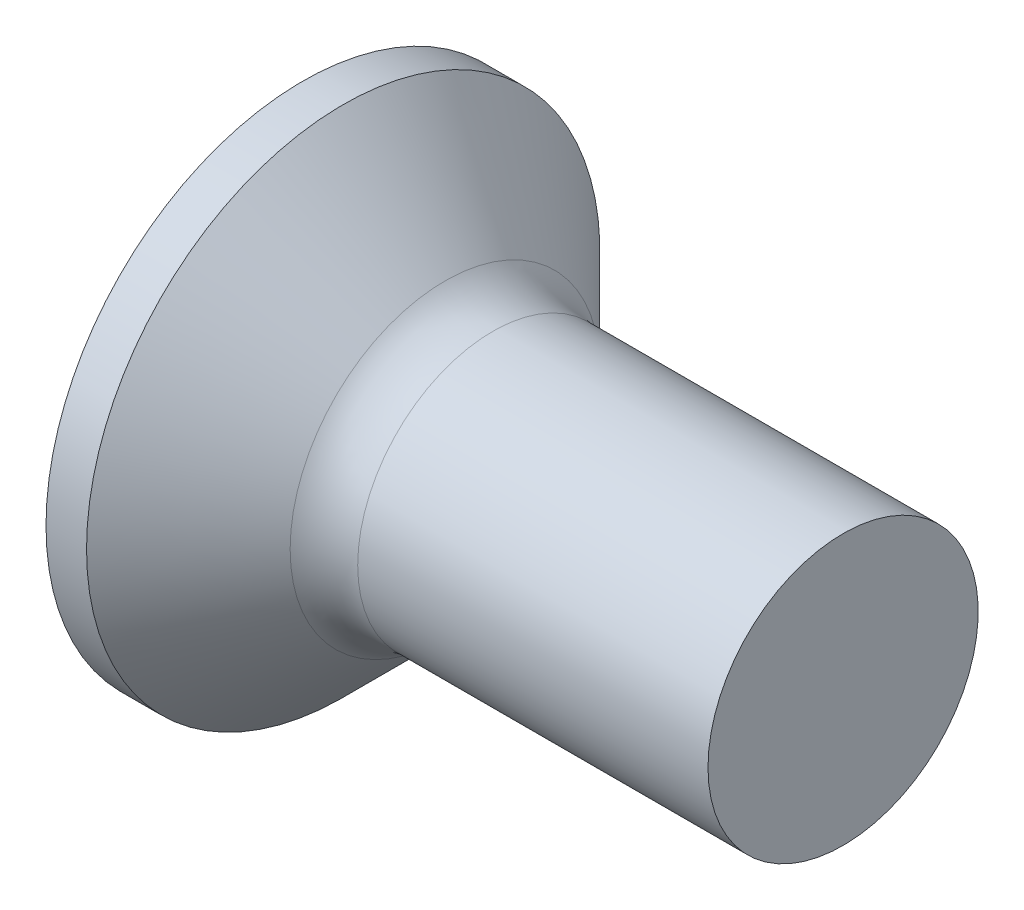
from build123d import *

# Parameters (mm, degrees)
FILLET1_R    = 0.5
RECPAT_COUNT = 2
RECPAT_ANGLE = 90


with BuildPart() as part:
    # BodySke → Base-Revolve (revolve)
    with BuildSketch(Plane.XY, mode=Mode.PRIVATE) as base_revolve_sk:
        Polygon((0, 0), (0, 1.9), (0.3, 1.9), (1.2, 1), (4, 1), (4, 0), align=None)
    revolve(base_revolve_sk.sketch.rotate(Axis((-6.35, 0, 0), (1, 0, 0)), 90), axis=Axis((-6.35, 0, 0), (1, 0, 0)))

    # Fillet1
    fillet1_edges = [part.edges().sort_by_distance(p)[0] for p in [
        (1.2, 0, -1),
    ]]
    fillet(fillet1_edges, radius=FILLET1_R)

    # Sketch3 → Recess section 0
    with BuildSketch(Plane.ZY):
        with BuildLine():
            Line((-0.24, 0.95), (0.24, 0.95))
            Line((0.24, 0.95), (0.24, -0.95))
            Line((0.24, -0.95), (-0.24, -0.95))
            Line((-0.24, -0.95), (-0.24, 0.95))
        make_face()
    # Sketch4 → Recess section 1
    with BuildSketch(Plane.ZY.offset(-1.2)):
        with BuildLine():
            Line((-0.24, 0.35170217), (0.24, 0.35170217))
            Line((0.24, 0.35170217), (0.24, -0.35170217))
            Line((0.24, -0.35170217), (-0.24, -0.35170217))
            Line((-0.24, -0.35170217), (-0.24, 0.35170217))
        make_face()
    recess = loft(mode=Mode.SUBTRACT)

    # RecPat: Recess ×2 about axis
    recpat_axis = Axis((0, 0, 0), (1, 0, 0))
    for i in range(1, RECPAT_COUNT):
        add(recess.rotate(recpat_axis, i * RECPAT_ANGLE / (RECPAT_COUNT - 1)), mode=Mode.SUBTRACT)

    # RecCorSke → RecessCore (revolve, cut)
    with BuildSketch(Plane.XY, mode=Mode.PRIVATE) as recesscore_sk:
        Polygon((0, 0), (0, 0.439412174), (1.2, 0.3555), (1.315508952, 0), align=None)
    revolve(recesscore_sk.sketch.rotate(Axis((-3.175, 0, 0), (1, 0, 0)), 90), axis=Axis((-3.175, 0, 0), (1, 0, 0)), mode=Mode.SUBTRACT)


solid = part.part
